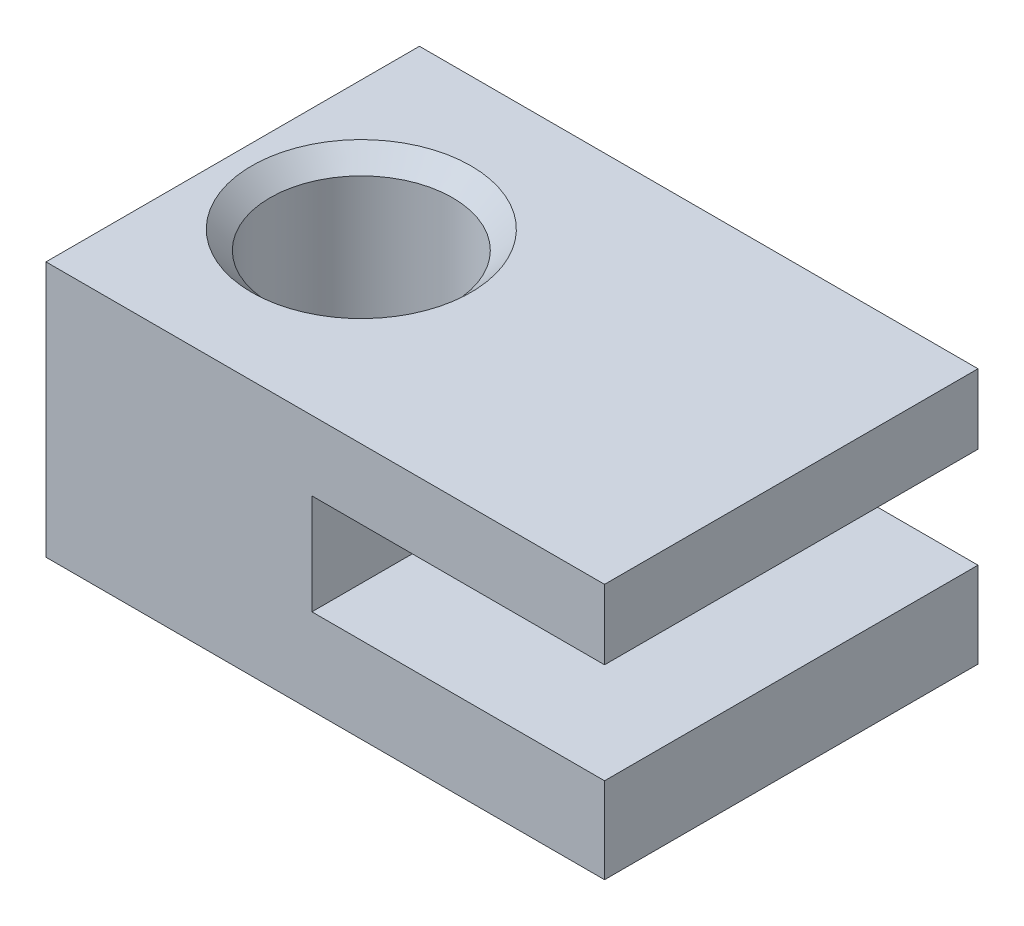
ISO-10303-21;
HEADER;
FILE_DESCRIPTION(('STEP AP214'),'2;1');
FILE_NAME('part.step','',(''),(''),'','','');
FILE_SCHEMA(('AUTOMOTIVE_DESIGN { 1 0 10303 214 1 1 1 1 }'));
ENDSEC;
DATA;
#1=APPLICATION_CONTEXT('core data for automotive mechanical design processes');
#2=APPLICATION_PROTOCOL_DEFINITION('international standard','automotive_design',2000,#1);
#3=PRODUCT_CONTEXT('',#1,'mechanical');
#4=PRODUCT('Part','Part','',(#3));
#5=PRODUCT_RELATED_PRODUCT_CATEGORY('part','',(#4));
#6=PRODUCT_DEFINITION_FORMATION('','',#4);
#7=PRODUCT_DEFINITION_CONTEXT('part definition',#1,'design');
#8=PRODUCT_DEFINITION('design','',#6,#7);
#9=PRODUCT_DEFINITION_SHAPE('','',#8);
#10=(LENGTH_UNIT() NAMED_UNIT(*) SI_UNIT(.MILLI.,.METRE.));
#11=(NAMED_UNIT(*) PLANE_ANGLE_UNIT() SI_UNIT($,.RADIAN.));
#12=(NAMED_UNIT(*) SI_UNIT($,.STERADIAN.) SOLID_ANGLE_UNIT());
#13=UNCERTAINTY_MEASURE_WITH_UNIT(LENGTH_MEASURE(1.E-05),#10,'distance_accuracy_value','');
#14=(GEOMETRIC_REPRESENTATION_CONTEXT(3) GLOBAL_UNCERTAINTY_ASSIGNED_CONTEXT((#13)) GLOBAL_UNIT_ASSIGNED_CONTEXT((#10,
#11,#12)) REPRESENTATION_CONTEXT('',''));
#15=CARTESIAN_POINT('',(0.,0.,0.));
#16=DIRECTION('',(0.,0.,1.));
#17=DIRECTION('',(1.,0.,0.));
#18=AXIS2_PLACEMENT_3D('',#15,#16,#17);
#19=CARTESIAN_POINT('',(90.5104219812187,70.612,-44.268252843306));
#20=DIRECTION('',(-1.,0.,0.));
#21=DIRECTION('',(0.,0.,1.));
#22=AXIS2_PLACEMENT_3D('',#19,#20,#21);
#23=PLANE('',#22);
#24=DIRECTION('',(0.,-1.,0.));
#25=VECTOR('',#24,1.);
#26=CARTESIAN_POINT('',(90.5104219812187,70.612,-44.268252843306));
#27=LINE('',#26,#25);
#28=CARTESIAN_POINT('',(90.5104219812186,23.660106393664,-44.2682528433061));
#29=VERTEX_POINT('',#28);
#30=CARTESIAN_POINT('',(90.5104219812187,0.,-44.268252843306));
#31=VERTEX_POINT('',#30);
#32=EDGE_CURVE('E152',#29,#31,#27,.T.);
#33=ORIENTED_EDGE('',*,*,#32,.F.);
#34=DIRECTION('',(0.,0.,1.));
#35=VECTOR('',#34,1.);
#36=CARTESIAN_POINT('',(90.5104219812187,23.660106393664,-44.268252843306));
#37=LINE('',#36,#35);
#38=CARTESIAN_POINT('',(90.5104219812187,23.660106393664,58.8040970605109));
#39=VERTEX_POINT('',#38);
#40=EDGE_CURVE('E128',#29,#39,#37,.T.);
#41=ORIENTED_EDGE('',*,*,#40,.T.);
#42=DIRECTION('',(0.,-1.,0.));
#43=VECTOR('',#42,1.);
#44=CARTESIAN_POINT('',(90.5104219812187,70.612,58.8040970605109));
#45=LINE('',#44,#43);
#46=CARTESIAN_POINT('',(90.5104219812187,0.,58.8040970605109));
#47=VERTEX_POINT('',#46);
#48=EDGE_CURVE('E156',#39,#47,#45,.T.);
#49=ORIENTED_EDGE('',*,*,#48,.T.);
#50=DIRECTION('',(0.,0.,-1.));
#51=VECTOR('',#50,1.);
#52=CARTESIAN_POINT('',(90.5104219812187,0.,-44.268252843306));
#53=LINE('',#52,#51);
#54=EDGE_CURVE('E137',#47,#31,#53,.T.);
#55=ORIENTED_EDGE('',*,*,#54,.T.);
#56=EDGE_LOOP('',(#33,#41,#49,#55));
#57=FACE_BOUND('',#56,.T.);
#58=ADVANCED_FACE('F31',(#57),#23,.F.);
#59=CARTESIAN_POINT('',(-63.6576227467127,70.612,-44.268252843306));
#60=DIRECTION('',(1.,0.,0.));
#61=DIRECTION('',(0.,0.,-1.));
#62=AXIS2_PLACEMENT_3D('',#59,#60,#61);
#63=PLANE('',#62);
#64=DIRECTION('',(0.,0.,1.));
#65=VECTOR('',#64,1.);
#66=CARTESIAN_POINT('',(-63.6576227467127,0.,-44.268252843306));
#67=LINE('',#66,#65);
#68=CARTESIAN_POINT('',(-63.6576227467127,0.,-44.268252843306));
#69=VERTEX_POINT('',#68);
#70=CARTESIAN_POINT('',(-63.6576227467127,0.,58.8040970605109));
#71=VERTEX_POINT('',#70);
#72=EDGE_CURVE('E131',#69,#71,#67,.T.);
#73=ORIENTED_EDGE('',*,*,#72,.T.);
#74=DIRECTION('',(0.,-1.,0.));
#75=VECTOR('',#74,1.);
#76=CARTESIAN_POINT('',(-63.6576227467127,70.612,58.8040970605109));
#77=LINE('',#76,#75);
#78=CARTESIAN_POINT('',(-63.6576227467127,70.612,58.8040970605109));
#79=VERTEX_POINT('',#78);
#80=EDGE_CURVE('E159',#79,#71,#77,.T.);
#81=ORIENTED_EDGE('',*,*,#80,.F.);
#82=DIRECTION('',(0.,0.,1.));
#83=VECTOR('',#82,1.);
#84=CARTESIAN_POINT('',(-63.6576227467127,70.612,-44.268252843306));
#85=LINE('',#84,#83);
#86=CARTESIAN_POINT('',(-63.6576227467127,70.612,-44.268252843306));
#87=VERTEX_POINT('',#86);
#88=EDGE_CURVE('E142',#87,#79,#85,.T.);
#89=ORIENTED_EDGE('',*,*,#88,.F.);
#90=DIRECTION('',(0.,-1.,0.));
#91=VECTOR('',#90,1.);
#92=CARTESIAN_POINT('',(-63.6576227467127,70.612,-44.268252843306));
#93=LINE('',#92,#91);
#94=EDGE_CURVE('E149',#87,#69,#93,.T.);
#95=ORIENTED_EDGE('',*,*,#94,.T.);
#96=EDGE_LOOP('',(#73,#81,#89,#95));
#97=FACE_BOUND('',#96,.T.);
#98=ADVANCED_FACE('F177',(#97),#63,.F.);
#99=CARTESIAN_POINT('',(-63.6576227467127,70.612,58.8040970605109));
#100=DIRECTION('',(0.,0.,-1.));
#101=DIRECTION('',(-1.,0.,0.));
#102=AXIS2_PLACEMENT_3D('',#99,#100,#101);
#103=PLANE('',#102);
#104=ORIENTED_EDGE('',*,*,#48,.F.);
#105=DIRECTION('',(1.,0.,0.));
#106=VECTOR('',#105,1.);
#107=CARTESIAN_POINT('',(93.7683238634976,23.660106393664,58.8040970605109));
#108=LINE('',#107,#106);
#109=CARTESIAN_POINT('',(9.74099024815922,23.660106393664,58.8040970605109));
#110=VERTEX_POINT('',#109);
#111=EDGE_CURVE('E118',#110,#39,#108,.T.);
#112=ORIENTED_EDGE('',*,*,#111,.F.);
#113=DIRECTION('',(0.,-1.,0.));
#114=VECTOR('',#113,1.);
#115=CARTESIAN_POINT('',(9.74099024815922,51.3743848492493,58.8040970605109));
#116=LINE('',#115,#114);
#117=CARTESIAN_POINT('',(9.74099024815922,51.3743848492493,58.8040970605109));
#118=VERTEX_POINT('',#117);
#119=EDGE_CURVE('E107',#118,#110,#116,.T.);
#120=ORIENTED_EDGE('',*,*,#119,.F.);
#121=DIRECTION('',(-1.,0.,0.));
#122=VECTOR('',#121,1.);
#123=CARTESIAN_POINT('',(93.7683238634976,51.3743848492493,58.8040970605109));
#124=LINE('',#123,#122);
#125=CARTESIAN_POINT('',(90.5104219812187,51.3743848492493,58.8040970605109));
#126=VERTEX_POINT('',#125);
#127=EDGE_CURVE('E97',#126,#118,#124,.T.);
#128=ORIENTED_EDGE('',*,*,#127,.F.);
#129=CARTESIAN_POINT('',(90.5104219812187,70.612,58.8040970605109));
#130=VERTEX_POINT('',#129);
#131=EDGE_CURVE('E157',#130,#126,#45,.T.);
#132=ORIENTED_EDGE('',*,*,#131,.F.);
#133=DIRECTION('',(1.,0.,0.));
#134=VECTOR('',#133,1.);
#135=CARTESIAN_POINT('',(-63.6576227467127,70.612,58.8040970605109));
#136=LINE('',#135,#134);
#137=EDGE_CURVE('E144',#79,#130,#136,.T.);
#138=ORIENTED_EDGE('',*,*,#137,.F.);
#139=ORIENTED_EDGE('',*,*,#80,.T.);
#140=DIRECTION('',(1.,0.,0.));
#141=VECTOR('',#140,1.);
#142=CARTESIAN_POINT('',(-63.6576227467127,0.,58.8040970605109));
#143=LINE('',#142,#141);
#144=EDGE_CURVE('E134',#71,#47,#143,.T.);
#145=ORIENTED_EDGE('',*,*,#144,.T.);
#146=EDGE_LOOP('',(#104,#112,#120,#128,#132,#138,#139,#145));
#147=FACE_BOUND('',#146,.T.);
#148=ADVANCED_FACE('F117',(#147),#103,.F.);
#149=ORIENTED_EDGE('',*,*,#131,.T.);
#150=DIRECTION('',(0.,0.,-1.));
#151=VECTOR('',#150,1.);
#152=CARTESIAN_POINT('',(90.5104219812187,51.3743848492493,-44.268252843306));
#153=LINE('',#152,#151);
#154=CARTESIAN_POINT('',(90.5104219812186,51.3743848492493,-44.2682528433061));
#155=VERTEX_POINT('',#154);
#156=EDGE_CURVE('E102',#126,#155,#153,.T.);
#157=ORIENTED_EDGE('',*,*,#156,.T.);
#158=CARTESIAN_POINT('',(90.5104219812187,70.612,-44.268252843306));
#159=VERTEX_POINT('',#158);
#160=EDGE_CURVE('E153',#159,#155,#27,.T.);
#161=ORIENTED_EDGE('',*,*,#160,.F.);
#162=DIRECTION('',(0.,0.,-1.));
#163=VECTOR('',#162,1.);
#164=CARTESIAN_POINT('',(90.5104219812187,70.612,-44.268252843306));
#165=LINE('',#164,#163);
#166=EDGE_CURVE('E146',#130,#159,#165,.T.);
#167=ORIENTED_EDGE('',*,*,#166,.F.);
#168=EDGE_LOOP('',(#149,#157,#161,#167));
#169=FACE_BOUND('',#168,.T.);
#170=ADVANCED_FACE('F180',(#169),#23,.F.);
#171=CARTESIAN_POINT('',(-63.6576227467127,70.612,-44.268252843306));
#172=DIRECTION('',(0.,0.,1.));
#173=DIRECTION('',(1.,0.,0.));
#174=AXIS2_PLACEMENT_3D('',#171,#172,#173);
#175=PLANE('',#174);
#176=DIRECTION('',(0.,-1.,0.));
#177=VECTOR('',#176,1.);
#178=CARTESIAN_POINT('',(9.74099024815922,51.3743848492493,-44.2682528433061));
#179=LINE('',#178,#177);
#180=CARTESIAN_POINT('',(9.74099024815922,51.3743848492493,-44.268252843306));
#181=VERTEX_POINT('',#180);
#182=CARTESIAN_POINT('',(9.74099024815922,23.660106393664,-44.2682528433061));
#183=VERTEX_POINT('',#182);
#184=EDGE_CURVE('E46',#181,#183,#179,.T.);
#185=ORIENTED_EDGE('',*,*,#184,.T.);
#186=DIRECTION('',(1.,0.,0.));
#187=VECTOR('',#186,1.);
#188=CARTESIAN_POINT('',(93.7683238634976,23.660106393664,-44.2682528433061));
#189=LINE('',#188,#187);
#190=EDGE_CURVE('E114',#183,#29,#189,.T.);
#191=ORIENTED_EDGE('',*,*,#190,.T.);
#192=ORIENTED_EDGE('',*,*,#32,.T.);
#193=DIRECTION('',(-1.,0.,0.));
#194=VECTOR('',#193,1.);
#195=CARTESIAN_POINT('',(-63.6576227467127,0.,-44.268252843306));
#196=LINE('',#195,#194);
#197=EDGE_CURVE('E140',#31,#69,#196,.T.);
#198=ORIENTED_EDGE('',*,*,#197,.T.);
#199=ORIENTED_EDGE('',*,*,#94,.F.);
#200=DIRECTION('',(-1.,0.,0.));
#201=VECTOR('',#200,1.);
#202=CARTESIAN_POINT('',(-63.6576227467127,70.612,-44.268252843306));
#203=LINE('',#202,#201);
#204=EDGE_CURVE('E54',#159,#87,#203,.T.);
#205=ORIENTED_EDGE('',*,*,#204,.F.);
#206=ORIENTED_EDGE('',*,*,#160,.T.);
#207=DIRECTION('',(-1.,0.,0.));
#208=VECTOR('',#207,1.);
#209=CARTESIAN_POINT('',(-63.6576227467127,51.3743848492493,-44.268252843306));
#210=LINE('',#209,#208);
#211=EDGE_CURVE('E162',#155,#181,#210,.T.);
#212=ORIENTED_EDGE('',*,*,#211,.T.);
#213=EDGE_LOOP('',(#185,#191,#192,#198,#199,#205,#206,#212));
#214=FACE_BOUND('',#213,.T.);
#215=ADVANCED_FACE('F189',(#214),#175,.F.);
#216=CARTESIAN_POINT('',(-63.6576227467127,70.612,58.8040970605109));
#217=DIRECTION('',(0.,1.,0.));
#218=DIRECTION('',(0.,0.,1.));
#219=AXIS2_PLACEMENT_3D('',#216,#217,#218);
#220=PLANE('',#219);
#221=CARTESIAN_POINT('',(-27.9715870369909,70.612,7.45869624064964));
#222=DIRECTION('',(0.,1.,0.));
#223=DIRECTION('',(0.,0.,1.));
#224=AXIS2_PLACEMENT_3D('',#221,#222,#223);
#225=CIRCLE('',#224,30.2621854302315);
#226=CARTESIAN_POINT('',(-27.9715870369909,70.612,37.7208816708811));
#227=VERTEX_POINT('',#226);
#228=EDGE_CURVE('E11',#227,#227,#225,.F.);
#229=ORIENTED_EDGE('',*,*,#228,.T.);
#230=EDGE_LOOP('',(#229));
#231=FACE_BOUND('',#230,.T.);
#232=ORIENTED_EDGE('',*,*,#88,.T.);
#233=ORIENTED_EDGE('',*,*,#137,.T.);
#234=ORIENTED_EDGE('',*,*,#166,.T.);
#235=ORIENTED_EDGE('',*,*,#204,.T.);
#236=EDGE_LOOP('',(#232,#233,#234,#235));
#237=FACE_BOUND('',#236,.T.);
#238=ADVANCED_FACE('F195',(#231,#237),#220,.T.);
#239=CARTESIAN_POINT('',(-63.6576227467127,0.,58.8040970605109));
#240=DIRECTION('',(0.,1.,0.));
#241=DIRECTION('',(0.,0.,1.));
#242=AXIS2_PLACEMENT_3D('',#239,#240,#241);
#243=PLANE('',#242);
#244=CARTESIAN_POINT('',(-27.9715870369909,0.,7.45869624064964));
#245=DIRECTION('',(0.,1.,0.));
#246=DIRECTION('',(0.,0.,1.));
#247=AXIS2_PLACEMENT_3D('',#244,#245,#246);
#248=CIRCLE('',#247,25.1821854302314);
#249=CARTESIAN_POINT('',(-27.9715870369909,0.,32.6408816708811));
#250=VERTEX_POINT('',#249);
#251=EDGE_CURVE('E108',#250,#250,#248,.T.);
#252=ORIENTED_EDGE('',*,*,#251,.T.);
#253=EDGE_LOOP('',(#252));
#254=FACE_BOUND('',#253,.T.);
#255=ORIENTED_EDGE('',*,*,#72,.F.);
#256=ORIENTED_EDGE('',*,*,#197,.F.);
#257=ORIENTED_EDGE('',*,*,#54,.F.);
#258=ORIENTED_EDGE('',*,*,#144,.F.);
#259=EDGE_LOOP('',(#255,#256,#257,#258));
#260=FACE_BOUND('',#259,.T.);
#261=ADVANCED_FACE('F204',(#254,#260),#243,.F.);
#262=CARTESIAN_POINT('',(93.7683238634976,23.660106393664,-44.2682528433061));
#263=DIRECTION('',(0.,-1.,0.));
#264=DIRECTION('',(0.,0.,-1.));
#265=AXIS2_PLACEMENT_3D('',#262,#263,#264);
#266=PLANE('',#265);
#267=ORIENTED_EDGE('',*,*,#190,.F.);
#268=DIRECTION('',(0.,0.,1.));
#269=VECTOR('',#268,1.);
#270=CARTESIAN_POINT('',(9.74099024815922,23.660106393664,-44.2682528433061));
#271=LINE('',#270,#269);
#272=EDGE_CURVE('E113',#183,#110,#271,.T.);
#273=ORIENTED_EDGE('',*,*,#272,.T.);
#274=ORIENTED_EDGE('',*,*,#111,.T.);
#275=ORIENTED_EDGE('',*,*,#40,.F.);
#276=EDGE_LOOP('',(#267,#273,#274,#275));
#277=FACE_BOUND('',#276,.T.);
#278=ADVANCED_FACE('F208',(#277),#266,.F.);
#279=CARTESIAN_POINT('',(93.7683238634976,51.3743848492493,-44.2682528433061));
#280=DIRECTION('',(0.,1.,0.));
#281=DIRECTION('',(0.,0.,1.));
#282=AXIS2_PLACEMENT_3D('',#279,#280,#281);
#283=PLANE('',#282);
#284=ORIENTED_EDGE('',*,*,#127,.T.);
#285=DIRECTION('',(0.,0.,1.));
#286=VECTOR('',#285,1.);
#287=CARTESIAN_POINT('',(9.74099024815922,51.3743848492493,-44.2682528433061));
#288=LINE('',#287,#286);
#289=EDGE_CURVE('E99',#181,#118,#288,.T.);
#290=ORIENTED_EDGE('',*,*,#289,.F.);
#291=ORIENTED_EDGE('',*,*,#211,.F.);
#292=ORIENTED_EDGE('',*,*,#156,.F.);
#293=EDGE_LOOP('',(#284,#290,#291,#292));
#294=FACE_BOUND('',#293,.T.);
#295=ADVANCED_FACE('F98',(#294),#283,.F.);
#296=CARTESIAN_POINT('',(9.74099024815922,51.3743848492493,-44.2682528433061));
#297=DIRECTION('',(-1.,0.,0.));
#298=DIRECTION('',(0.,0.,1.));
#299=AXIS2_PLACEMENT_3D('',#296,#297,#298);
#300=PLANE('',#299);
#301=ORIENTED_EDGE('',*,*,#119,.T.);
#302=ORIENTED_EDGE('',*,*,#272,.F.);
#303=ORIENTED_EDGE('',*,*,#184,.F.);
#304=ORIENTED_EDGE('',*,*,#289,.T.);
#305=EDGE_LOOP('',(#301,#302,#303,#304));
#306=FACE_BOUND('',#305,.T.);
#307=ADVANCED_FACE('F111',(#306),#300,.F.);
#308=CARTESIAN_POINT('',(-27.9715870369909,0.,7.45869624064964));
#309=DIRECTION('',(0.,1.,0.));
#310=DIRECTION('',(0.,0.,1.));
#311=AXIS2_PLACEMENT_3D('',#308,#309,#310);
#312=CYLINDRICAL_SURFACE('',#311,25.1821854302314);
#313=CARTESIAN_POINT('',(-27.9715870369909,65.532,7.45869624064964));
#314=DIRECTION('',(0.,1.,0.));
#315=DIRECTION('',(0.,0.,1.));
#316=AXIS2_PLACEMENT_3D('',#313,#314,#315);
#317=CIRCLE('',#316,25.1821854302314);
#318=CARTESIAN_POINT('',(-27.9715870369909,65.532,32.6408816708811));
#319=VERTEX_POINT('',#318);
#320=EDGE_CURVE('E39',#319,#319,#317,.T.);
#321=ORIENTED_EDGE('',*,*,#320,.T.);
#322=EDGE_LOOP('',(#321));
#323=FACE_BOUND('',#322,.T.);
#324=ORIENTED_EDGE('',*,*,#251,.F.);
#325=EDGE_LOOP('',(#324));
#326=FACE_BOUND('',#325,.T.);
#327=ADVANCED_FACE('F166',(#323,#326),#312,.F.);
#328=CARTESIAN_POINT('',(-27.9715870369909,65.532,7.45869624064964));
#329=DIRECTION('',(0.,1.,0.));
#330=DIRECTION('',(0.,0.,1.));
#331=AXIS2_PLACEMENT_3D('',#328,#329,#330);
#332=CONICAL_SURFACE('',#331,25.1821854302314,0.78539816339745);
#333=CARTESIAN_POINT('',(-27.9715870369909,70.612,37.7208816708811));
#334=CARTESIAN_POINT('',(-27.9715870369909,70.5590833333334,37.6679650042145));
#335=CARTESIAN_POINT('',(-27.9715870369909,70.5061666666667,37.6150483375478));
#336=CARTESIAN_POINT('',(-27.9715870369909,70.4003333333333,37.5092150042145));
#337=CARTESIAN_POINT('',(-27.9715870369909,70.3474166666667,37.4562983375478));
#338=CARTESIAN_POINT('',(-27.9715870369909,70.2415833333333,37.3504650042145));
#339=CARTESIAN_POINT('',(-27.9715870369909,70.1886666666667,37.2975483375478));
#340=CARTESIAN_POINT('',(-27.9715870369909,70.0828333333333,37.1917150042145));
#341=CARTESIAN_POINT('',(-27.9715870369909,70.0299166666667,37.1387983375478));
#342=CARTESIAN_POINT('',(-27.9715870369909,69.9240833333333,37.0329650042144));
#343=CARTESIAN_POINT('',(-27.9715870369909,69.8711666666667,36.9800483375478));
#344=CARTESIAN_POINT('',(-27.9715870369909,69.7653333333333,36.8742150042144));
#345=CARTESIAN_POINT('',(-27.9715870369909,69.7124166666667,36.8212983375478));
#346=CARTESIAN_POINT('',(-27.9715870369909,69.6065833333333,36.7154650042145));
#347=CARTESIAN_POINT('',(-27.9715870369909,69.5536666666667,36.6625483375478));
#348=CARTESIAN_POINT('',(-27.9715870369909,69.4478333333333,36.5567150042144));
#349=CARTESIAN_POINT('',(-27.9715870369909,69.3949166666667,36.5037983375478));
#350=CARTESIAN_POINT('',(-27.9715870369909,69.2890833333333,36.3979650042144));
#351=CARTESIAN_POINT('',(-27.9715870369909,69.2361666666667,36.3450483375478));
#352=CARTESIAN_POINT('',(-27.9715870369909,69.1303333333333,36.2392150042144));
#353=CARTESIAN_POINT('',(-27.9715870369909,69.0774166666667,36.1862983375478));
#354=CARTESIAN_POINT('',(-27.9715870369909,68.9715833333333,36.0804650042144));
#355=CARTESIAN_POINT('',(-27.9715870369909,68.9186666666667,36.0275483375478));
#356=CARTESIAN_POINT('',(-27.9715870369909,68.8128333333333,35.9217150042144));
#357=CARTESIAN_POINT('',(-27.9715870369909,68.7599166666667,35.8687983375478));
#358=CARTESIAN_POINT('',(-27.9715870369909,68.6540833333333,35.7629650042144));
#359=CARTESIAN_POINT('',(-27.9715870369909,68.6011666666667,35.7100483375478));
#360=CARTESIAN_POINT('',(-27.9715870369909,68.4953333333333,35.6042150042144));
#361=CARTESIAN_POINT('',(-27.9715870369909,68.4424166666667,35.5512983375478));
#362=CARTESIAN_POINT('',(-27.9715870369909,68.3365833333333,35.4454650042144));
#363=CARTESIAN_POINT('',(-27.9715870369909,68.2836666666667,35.3925483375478));
#364=CARTESIAN_POINT('',(-27.9715870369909,68.1778333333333,35.2867150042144));
#365=CARTESIAN_POINT('',(-27.9715870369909,68.1249166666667,35.2337983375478));
#366=CARTESIAN_POINT('',(-27.9715870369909,68.0190833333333,35.1279650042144));
#367=CARTESIAN_POINT('',(-27.9715870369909,67.9661666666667,35.0750483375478));
#368=CARTESIAN_POINT('',(-27.9715870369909,67.8603333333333,34.9692150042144));
#369=CARTESIAN_POINT('',(-27.9715870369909,67.8074166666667,34.9162983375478));
#370=CARTESIAN_POINT('',(-27.9715870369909,67.7015833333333,34.8104650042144));
#371=CARTESIAN_POINT('',(-27.9715870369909,67.6486666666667,34.7575483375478));
#372=CARTESIAN_POINT('',(-27.9715870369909,67.5428333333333,34.6517150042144));
#373=CARTESIAN_POINT('',(-27.9715870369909,67.4899166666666,34.5987983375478));
#374=CARTESIAN_POINT('',(-27.9715870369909,67.3840833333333,34.4929650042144));
#375=CARTESIAN_POINT('',(-27.9715870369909,67.3311666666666,34.4400483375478));
#376=CARTESIAN_POINT('',(-27.9715870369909,67.2253333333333,34.3342150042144));
#377=CARTESIAN_POINT('',(-27.9715870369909,67.1724166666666,34.2812983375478));
#378=CARTESIAN_POINT('',(-27.9715870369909,67.0665833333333,34.1754650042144));
#379=CARTESIAN_POINT('',(-27.9715870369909,67.0136666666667,34.1225483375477));
#380=CARTESIAN_POINT('',(-27.9715870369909,66.9078333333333,34.0167150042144));
#381=CARTESIAN_POINT('',(-27.9715870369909,66.8549166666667,33.9637983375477));
#382=CARTESIAN_POINT('',(-27.9715870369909,66.7490833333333,33.8579650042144));
#383=CARTESIAN_POINT('',(-27.9715870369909,66.6961666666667,33.8050483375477));
#384=CARTESIAN_POINT('',(-27.9715870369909,66.5903333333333,33.6992150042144));
#385=CARTESIAN_POINT('',(-27.9715870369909,66.5374166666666,33.6462983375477));
#386=CARTESIAN_POINT('',(-27.9715870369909,66.4315833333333,33.5404650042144));
#387=CARTESIAN_POINT('',(-27.9715870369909,66.3786666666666,33.4875483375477));
#388=CARTESIAN_POINT('',(-27.9715870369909,66.2728333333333,33.3817150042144));
#389=CARTESIAN_POINT('',(-27.9715870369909,66.2199166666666,33.3287983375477));
#390=CARTESIAN_POINT('',(-27.9715870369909,66.1140833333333,33.2229650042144));
#391=CARTESIAN_POINT('',(-27.9715870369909,66.0611666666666,33.1700483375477));
#392=CARTESIAN_POINT('',(-27.9715870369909,65.9553333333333,33.0642150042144));
#393=CARTESIAN_POINT('',(-27.9715870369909,65.9024166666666,33.0112983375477));
#394=CARTESIAN_POINT('',(-27.9715870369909,65.7965833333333,32.9054650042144));
#395=CARTESIAN_POINT('',(-27.9715870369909,65.7436666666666,32.8525483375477));
#396=CARTESIAN_POINT('',(-27.9715870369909,65.6378333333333,32.7467150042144));
#397=CARTESIAN_POINT('',(-27.9715870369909,65.5849166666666,32.6937983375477));
#398=CARTESIAN_POINT('',(-27.9715870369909,65.532,32.6408816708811));
#399=B_SPLINE_CURVE_WITH_KNOTS('',3,(#333,#334,#335,#336,#337,#338,#339,#340,#341,#342,#343,
#344,#345,#346,#347,#348,#349,#350,#351,#352,#353,#354,#355,#356,#357,#358,#359,#360,#361,#362,
#363,#364,#365,#366,#367,#368,#369,#370,#371,#372,#373,#374,#375,#376,#377,#378,#379,#380,#381,
#382,#383,#384,#385,#386,#387,#388,#389,#390,#391,#392,#393,#394,#395,#396,#397,#398),
.UNSPECIFIED.,.F.,.F.,(4,2,2,2,2,2,2,2,2,2,2,2,2,2,2,2,2,2,2,2,2,2,2,2,2,2,2,2,2,2,2,2,4),(0.,
0.224506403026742,0.44901280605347,0.673519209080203,0.89802561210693,1.12253201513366,
1.34703841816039,1.57154482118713,1.79605122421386,2.02055762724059,2.24506403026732,
2.46957043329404,2.69407683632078,2.9185832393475,3.14308964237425,3.36759604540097,
3.5921024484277,3.81660885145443,4.04111525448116,4.26562165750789,4.49012806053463,
4.71463446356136,4.93914086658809,5.16364726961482,5.38815367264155,5.61266007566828,
5.83716647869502,6.06167288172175,6.28617928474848,6.51068568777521,6.73519209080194,
6.95969849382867,7.18420489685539),.UNSPECIFIED.);
#400=EDGE_CURVE('BSEAM33',#227,#319,#399,.T.);
#401=ORIENTED_EDGE('',*,*,#228,.F.);
#402=ORIENTED_EDGE('',*,*,#320,.F.);
#403=ORIENTED_EDGE('',*,*,#400,.T.);
#404=ORIENTED_EDGE('',*,*,#400,.F.);
#405=EDGE_LOOP('',(#401,#403,#402,#404));
#406=FACE_BOUND('',#405,.T.);
#407=ADVANCED_FACE('F33',(#406),#332,.F.);
#408=CLOSED_SHELL('',(#58,#98,#148,#170,#215,#238,#261,#278,#295,#307,#327,#407));
#409=MANIFOLD_SOLID_BREP('B2',#408);
#410=ADVANCED_BREP_SHAPE_REPRESENTATION('',(#18,#409),#14);
#411=SHAPE_DEFINITION_REPRESENTATION(#9,#410);
ENDSEC;
END-ISO-10303-21;
